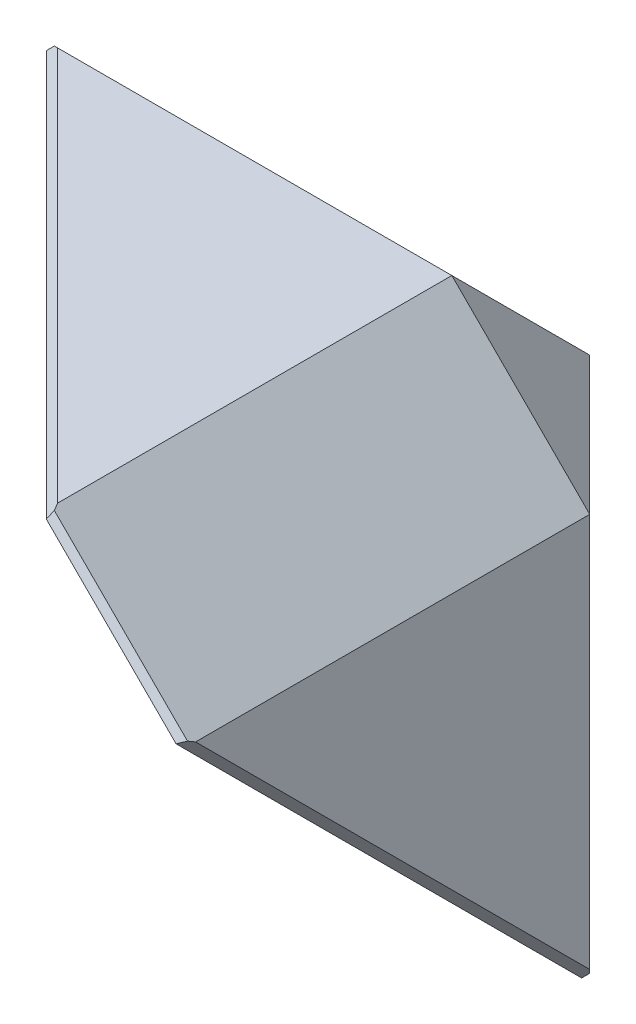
ISO-10303-21;
HEADER;
FILE_DESCRIPTION(('STEP AP214'),'2;1');
FILE_NAME('part.step','',(''),(''),'','','');
FILE_SCHEMA(('AUTOMOTIVE_DESIGN { 1 0 10303 214 1 1 1 1 }'));
ENDSEC;
DATA;
#1=APPLICATION_CONTEXT('core data for automotive mechanical design processes');
#2=APPLICATION_PROTOCOL_DEFINITION('international standard','automotive_design',2000,#1);
#3=PRODUCT_CONTEXT('',#1,'mechanical');
#4=PRODUCT('Part','Part','',(#3));
#5=PRODUCT_RELATED_PRODUCT_CATEGORY('part','',(#4));
#6=PRODUCT_DEFINITION_FORMATION('','',#4);
#7=PRODUCT_DEFINITION_CONTEXT('part definition',#1,'design');
#8=PRODUCT_DEFINITION('design','',#6,#7);
#9=PRODUCT_DEFINITION_SHAPE('','',#8);
#10=(LENGTH_UNIT() NAMED_UNIT(*) SI_UNIT(.MILLI.,.METRE.));
#11=(NAMED_UNIT(*) PLANE_ANGLE_UNIT() SI_UNIT($,.RADIAN.));
#12=(NAMED_UNIT(*) SI_UNIT($,.STERADIAN.) SOLID_ANGLE_UNIT());
#13=UNCERTAINTY_MEASURE_WITH_UNIT(LENGTH_MEASURE(1.E-05),#10,'distance_accuracy_value','');
#14=(GEOMETRIC_REPRESENTATION_CONTEXT(3) GLOBAL_UNCERTAINTY_ASSIGNED_CONTEXT((#13)) GLOBAL_UNIT_ASSIGNED_CONTEXT((#10,
#11,#12)) REPRESENTATION_CONTEXT('',''));
#15=CARTESIAN_POINT('',(0.,0.,0.));
#16=DIRECTION('',(0.,0.,1.));
#17=DIRECTION('',(1.,0.,0.));
#18=AXIS2_PLACEMENT_3D('',#15,#16,#17);
#19=CARTESIAN_POINT('',(7.5,7.5,15.));
#20=DIRECTION('',(-1.,0.,0.));
#21=DIRECTION('',(0.,-1.,0.));
#22=AXIS2_PLACEMENT_3D('',#19,#20,#21);
#23=PLANE('',#22);
#24=DIRECTION('',(0.,0.,1.));
#25=VECTOR('',#24,1.);
#26=CARTESIAN_POINT('',(7.5,4.49999999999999,15.));
#27=LINE('',#26,#25);
#28=CARTESIAN_POINT('',(7.5,4.49999999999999,3.));
#29=VERTEX_POINT('',#28);
#30=CARTESIAN_POINT('',(7.5,4.49999999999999,11.5757359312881));
#31=VERTEX_POINT('',#30);
#32=EDGE_CURVE('E155',#29,#31,#27,.T.);
#33=ORIENTED_EDGE('',*,*,#32,.T.);
#34=DIRECTION('',(0.,-0.707106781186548,-0.707106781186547));
#35=VECTOR('',#34,1.);
#36=CARTESIAN_POINT('',(7.5,-4.28786796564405,2.78786796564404));
#37=LINE('',#36,#35);
#38=CARTESIAN_POINT('',(7.5,-4.07573593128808,3.));
#39=VERTEX_POINT('',#38);
#40=EDGE_CURVE('E11',#31,#39,#37,.T.);
#41=ORIENTED_EDGE('',*,*,#40,.T.);
#42=DIRECTION('',(0.,1.,0.));
#43=VECTOR('',#42,1.);
#44=CARTESIAN_POINT('',(7.5,7.5,3.));
#45=LINE('',#44,#43);
#46=EDGE_CURVE('E153',#39,#29,#45,.T.);
#47=ORIENTED_EDGE('',*,*,#46,.T.);
#48=EDGE_LOOP('',(#33,#41,#47));
#49=FACE_BOUND('',#48,.T.);
#50=ADVANCED_FACE('F45',(#49),#23,.F.);
#51=CARTESIAN_POINT('',(-7.5,7.5,15.));
#52=DIRECTION('',(0.,-1.,0.));
#53=DIRECTION('',(0.,0.,-1.));
#54=AXIS2_PLACEMENT_3D('',#51,#52,#53);
#55=PLANE('',#54);
#56=DIRECTION('',(-1.,0.,0.));
#57=VECTOR('',#56,1.);
#58=CARTESIAN_POINT('',(-7.5,7.5,3.));
#59=LINE('',#58,#57);
#60=CARTESIAN_POINT('',(4.5,7.5,3.));
#61=VERTEX_POINT('',#60);
#62=CARTESIAN_POINT('',(-4.07573593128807,7.5,3.));
#63=VERTEX_POINT('',#62);
#64=EDGE_CURVE('E147',#61,#63,#59,.T.);
#65=ORIENTED_EDGE('',*,*,#64,.T.);
#66=DIRECTION('',(0.707106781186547,0.,0.707106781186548));
#67=VECTOR('',#66,1.);
#68=CARTESIAN_POINT('',(4.71213203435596,7.5,11.787867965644));
#69=LINE('',#68,#67);
#70=CARTESIAN_POINT('',(4.5,7.5,11.5757359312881));
#71=VERTEX_POINT('',#70);
#72=EDGE_CURVE('E198',#63,#71,#69,.T.);
#73=ORIENTED_EDGE('',*,*,#72,.T.);
#74=DIRECTION('',(0.,0.,-1.));
#75=VECTOR('',#74,1.);
#76=CARTESIAN_POINT('',(4.5,7.5,15.));
#77=LINE('',#76,#75);
#78=EDGE_CURVE('E150',#71,#61,#77,.T.);
#79=ORIENTED_EDGE('',*,*,#78,.T.);
#80=EDGE_LOOP('',(#65,#73,#79));
#81=FACE_BOUND('',#80,.T.);
#82=ADVANCED_FACE('F250',(#81),#55,.F.);
#83=CARTESIAN_POINT('',(0.,0.,0.));
#84=DIRECTION('',(0.,0.,1.));
#85=DIRECTION('',(1.,0.,0.));
#86=AXIS2_PLACEMENT_3D('',#83,#84,#85);
#87=PLANE('',#86);
#88=DIRECTION('',(0.,-1.,0.));
#89=VECTOR('',#88,1.);
#90=CARTESIAN_POINT('',(4.49999999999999,0.,0.));
#91=LINE('',#90,#89);
#92=CARTESIAN_POINT('',(4.49999999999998,4.49999999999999,0.));
#93=VERTEX_POINT('',#92);
#94=CARTESIAN_POINT('',(4.49999999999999,-4.07573593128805,0.));
#95=VERTEX_POINT('',#94);
#96=EDGE_CURVE('E160',#93,#95,#91,.T.);
#97=ORIENTED_EDGE('',*,*,#96,.T.);
#98=DIRECTION('',(-0.707106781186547,0.707106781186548,0.));
#99=VECTOR('',#98,1.);
#100=CARTESIAN_POINT('',(-4.28786796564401,4.71213203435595,0.));
#101=LINE('',#100,#99);
#102=CARTESIAN_POINT('',(-4.07573593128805,4.49999999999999,0.));
#103=VERTEX_POINT('',#102);
#104=EDGE_CURVE('E190',#95,#103,#101,.T.);
#105=ORIENTED_EDGE('',*,*,#104,.T.);
#106=DIRECTION('',(1.,0.,0.));
#107=VECTOR('',#106,1.);
#108=CARTESIAN_POINT('',(0.,4.49999999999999,0.));
#109=LINE('',#108,#107);
#110=EDGE_CURVE('E158',#103,#93,#109,.T.);
#111=ORIENTED_EDGE('',*,*,#110,.T.);
#112=EDGE_LOOP('',(#97,#105,#111));
#113=FACE_BOUND('',#112,.T.);
#114=ADVANCED_FACE('F266',(#113),#87,.F.);
#115=CARTESIAN_POINT('',(0.,0.,0.));
#116=DIRECTION('',(-0.577350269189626,-0.577350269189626,0.577350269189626));
#117=DIRECTION('',(0.707106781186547,0.,0.707106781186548));
#118=AXIS2_PLACEMENT_3D('',#115,#116,#117);
#119=PLANE('',#118);
#120=CARTESIAN_POINT('',(3.72474487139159,0.0505102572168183,3.77525512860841));
#121=DIRECTION('',(-0.577350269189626,-0.577350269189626,0.577350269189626));
#122=DIRECTION('',(0.707106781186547,0.,0.707106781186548));
#123=AXIS2_PLACEMENT_3D('',#120,#121,#122);
#124=CIRCLE('',#123,0.749999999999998);
#125=CARTESIAN_POINT('',(4.2550749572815,0.0505102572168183,4.30558521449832));
#126=VERTEX_POINT('',#125);
#127=EDGE_CURVE('E144',#126,#126,#124,.T.);
#128=ORIENTED_EDGE('',*,*,#127,.F.);
#129=EDGE_LOOP('',(#128));
#130=FACE_BOUND('',#129,.T.);
#131=DIRECTION('',(0.707106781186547,-0.707106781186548,0.));
#132=VECTOR('',#131,1.);
#133=CARTESIAN_POINT('',(4.58786796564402,-4.41213203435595,0.175735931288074));
#134=LINE('',#133,#132);
#135=CARTESIAN_POINT('',(-4.32426406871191,4.49999999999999,0.175735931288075));
#136=VERTEX_POINT('',#135);
#137=CARTESIAN_POINT('',(4.49999999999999,-4.32426406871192,0.175735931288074));
#138=VERTEX_POINT('',#137);
#139=EDGE_CURVE('E178',#136,#138,#134,.T.);
#140=ORIENTED_EDGE('',*,*,#139,.T.);
#141=DIRECTION('',(0.707106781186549,0.,0.707106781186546));
#142=VECTOR('',#141,1.);
#143=CARTESIAN_POINT('',(2.16213203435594,-4.3242640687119,-2.16213203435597));
#144=LINE('',#143,#142);
#145=CARTESIAN_POINT('',(7.32426406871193,-4.32426406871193,3.));
#146=VERTEX_POINT('',#145);
#147=EDGE_CURVE('E180',#138,#146,#144,.T.);
#148=ORIENTED_EDGE('',*,*,#147,.T.);
#149=DIRECTION('',(0.,0.707106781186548,0.707106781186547));
#150=VECTOR('',#149,1.);
#151=CARTESIAN_POINT('',(7.32426406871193,4.58786796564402,11.912132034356));
#152=LINE('',#151,#150);
#153=CARTESIAN_POINT('',(7.32426406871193,4.49999999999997,11.8242640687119));
#154=VERTEX_POINT('',#153);
#155=EDGE_CURVE('E163',#146,#154,#152,.T.);
#156=ORIENTED_EDGE('',*,*,#155,.T.);
#157=DIRECTION('',(-0.707106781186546,0.707106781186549,0.));
#158=VECTOR('',#157,1.);
#159=CARTESIAN_POINT('',(5.91213203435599,5.91213203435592,11.8242640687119));
#160=LINE('',#159,#158);
#161=CARTESIAN_POINT('',(4.49999999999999,7.32426406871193,11.8242640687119));
#162=VERTEX_POINT('',#161);
#163=EDGE_CURVE('E172',#154,#162,#160,.T.);
#164=ORIENTED_EDGE('',*,*,#163,.T.);
#165=DIRECTION('',(-0.707106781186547,0.,-0.707106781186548));
#166=VECTOR('',#165,1.);
#167=CARTESIAN_POINT('',(-4.41213203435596,7.32426406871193,2.91213203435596));
#168=LINE('',#167,#166);
#169=CARTESIAN_POINT('',(-4.32426406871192,7.32426406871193,3.));
#170=VERTEX_POINT('',#169);
#171=EDGE_CURVE('E174',#162,#170,#168,.T.);
#172=ORIENTED_EDGE('',*,*,#171,.T.);
#173=DIRECTION('',(0.,-0.707106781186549,-0.707106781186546));
#174=VECTOR('',#173,1.);
#175=CARTESIAN_POINT('',(-4.3242640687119,2.16213203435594,-2.16213203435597));
#176=LINE('',#175,#174);
#177=EDGE_CURVE('E176',#170,#136,#176,.T.);
#178=ORIENTED_EDGE('',*,*,#177,.T.);
#179=EDGE_LOOP('',(#140,#148,#156,#164,#172,#178));
#180=FACE_BOUND('',#179,.T.);
#181=CARTESIAN_POINT('',(2.5,2.5,5.));
#182=DIRECTION('',(-0.577350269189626,-0.577350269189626,0.577350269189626));
#183=DIRECTION('',(0.707106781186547,0.,0.707106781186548));
#184=AXIS2_PLACEMENT_3D('',#181,#182,#183);
#185=CIRCLE('',#184,1.02499999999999);
#186=CARTESIAN_POINT('',(3.2247844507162,2.5,5.7247844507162));
#187=VERTEX_POINT('',#186);
#188=EDGE_CURVE('E136',#187,#187,#185,.T.);
#189=ORIENTED_EDGE('',*,*,#188,.F.);
#190=EDGE_LOOP('',(#189));
#191=FACE_BOUND('',#190,.T.);
#192=ADVANCED_FACE('F225',(#130,#180,#191),#119,.T.);
#193=CARTESIAN_POINT('',(-7.5,7.5,3.));
#194=DIRECTION('',(0.,-0.707106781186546,0.707106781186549));
#195=DIRECTION('',(-1.,0.,0.));
#196=AXIS2_PLACEMENT_3D('',#193,#194,#195);
#197=PLANE('',#196);
#198=ORIENTED_EDGE('',*,*,#110,.F.);
#199=DIRECTION('',(0.862856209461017,-0.357406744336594,-0.357406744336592));
#200=VECTOR('',#199,1.);
#201=CARTESIAN_POINT('',(-8.47551565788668,6.32244843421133,1.82244843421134));
#202=LINE('',#201,#200);
#203=CARTESIAN_POINT('',(-4.19999999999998,4.55147186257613,0.0514718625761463));
#204=VERTEX_POINT('',#203);
#205=EDGE_CURVE('E196',#103,#204,#202,.F.);
#206=ORIENTED_EDGE('',*,*,#205,.T.);
#207=DIRECTION('',(0.,-0.707106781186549,-0.707106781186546));
#208=VECTOR('',#207,1.);
#209=CARTESIAN_POINT('',(-4.2,7.50000000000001,3.00000000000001));
#210=LINE('',#209,#208);
#211=CARTESIAN_POINT('',(-4.2,7.44852813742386,2.94852813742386));
#212=VERTEX_POINT('',#211);
#213=EDGE_CURVE('E194',#204,#212,#210,.F.);
#214=ORIENTED_EDGE('',*,*,#213,.T.);
#215=DIRECTION('',(-0.862856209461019,-0.357406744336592,-0.35740674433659));
#216=VECTOR('',#215,1.);
#217=CARTESIAN_POINT('',(-6.62517188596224,6.44398905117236,1.94398905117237));
#218=LINE('',#217,#216);
#219=EDGE_CURVE('E192',#212,#63,#218,.F.);
#220=ORIENTED_EDGE('',*,*,#219,.T.);
#221=ORIENTED_EDGE('',*,*,#64,.F.);
#222=DIRECTION('',(0.,-0.707106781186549,-0.707106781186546));
#223=VECTOR('',#222,1.);
#224=CARTESIAN_POINT('',(4.5,7.5,3.));
#225=LINE('',#224,#223);
#226=EDGE_CURVE('E151',#93,#61,#225,.F.);
#227=ORIENTED_EDGE('',*,*,#226,.F.);
#228=EDGE_LOOP('',(#198,#206,#214,#220,#221,#227));
#229=FACE_BOUND('',#228,.T.);
#230=ADVANCED_FACE('F268',(#229),#197,.F.);
#231=CARTESIAN_POINT('',(7.5,7.5,3.));
#232=DIRECTION('',(-0.707106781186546,0.,0.707106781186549));
#233=DIRECTION('',(0.,1.,0.));
#234=AXIS2_PLACEMENT_3D('',#231,#232,#233);
#235=PLANE('',#234);
#236=DIRECTION('',(0.707106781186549,0.,0.707106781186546));
#237=VECTOR('',#236,1.);
#238=CARTESIAN_POINT('',(7.49999999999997,-4.2,2.99999999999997));
#239=LINE('',#238,#237);
#240=CARTESIAN_POINT('',(7.44852813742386,-4.2,2.94852813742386));
#241=VERTEX_POINT('',#240);
#242=CARTESIAN_POINT('',(4.55147186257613,-4.19999999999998,0.0514718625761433));
#243=VERTEX_POINT('',#242);
#244=EDGE_CURVE('E185',#241,#243,#239,.F.);
#245=ORIENTED_EDGE('',*,*,#244,.T.);
#246=DIRECTION('',(0.357406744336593,-0.862856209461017,0.357406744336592));
#247=VECTOR('',#246,1.);
#248=CARTESIAN_POINT('',(1.69658900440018,2.69229691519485,-2.80341099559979));
#249=LINE('',#248,#247);
#250=EDGE_CURVE('E188',#243,#95,#249,.F.);
#251=ORIENTED_EDGE('',*,*,#250,.T.);
#252=ORIENTED_EDGE('',*,*,#96,.F.);
#253=DIRECTION('',(0.707106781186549,0.,0.707106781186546));
#254=VECTOR('',#253,1.);
#255=CARTESIAN_POINT('',(5.99999999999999,4.49999999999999,1.5));
#256=LINE('',#255,#254);
#257=EDGE_CURVE('E166',#29,#93,#256,.F.);
#258=ORIENTED_EDGE('',*,*,#257,.F.);
#259=ORIENTED_EDGE('',*,*,#46,.F.);
#260=DIRECTION('',(0.357406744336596,0.862856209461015,0.357406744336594));
#261=VECTOR('',#260,1.);
#262=CARTESIAN_POINT('',(11.0698484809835,4.54264068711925,6.56984848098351));
#263=LINE('',#262,#261);
#264=EDGE_CURVE('E183',#39,#241,#263,.F.);
#265=ORIENTED_EDGE('',*,*,#264,.T.);
#266=EDGE_LOOP('',(#245,#251,#252,#258,#259,#265));
#267=FACE_BOUND('',#266,.T.);
#268=ADVANCED_FACE('F244',(#267),#235,.F.);
#269=CARTESIAN_POINT('',(4.5,7.5,3.));
#270=DIRECTION('',(0.577350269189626,0.577350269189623,-0.577350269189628));
#271=DIRECTION('',(-0.707106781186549,0.,-0.707106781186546));
#272=AXIS2_PLACEMENT_3D('',#269,#270,#271);
#273=PLANE('',#272);
#274=ORIENTED_EDGE('',*,*,#257,.T.);
#275=ORIENTED_EDGE('',*,*,#226,.T.);
#276=DIRECTION('',(-0.707106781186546,0.707106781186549,0.));
#277=VECTOR('',#276,1.);
#278=CARTESIAN_POINT('',(4.5,7.5,3.));
#279=LINE('',#278,#277);
#280=EDGE_CURVE('E139',#29,#61,#279,.T.);
#281=ORIENTED_EDGE('',*,*,#280,.F.);
#282=EDGE_LOOP('',(#274,#275,#281));
#283=FACE_BOUND('',#282,.T.);
#284=ADVANCED_FACE('F247',(#283),#273,.T.);
#285=CARTESIAN_POINT('',(4.5,7.5,15.));
#286=DIRECTION('',(-0.707106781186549,-0.707106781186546,0.));
#287=DIRECTION('',(0.,0.,-1.));
#288=AXIS2_PLACEMENT_3D('',#285,#286,#287);
#289=PLANE('',#288);
#290=ORIENTED_EDGE('',*,*,#78,.F.);
#291=DIRECTION('',(-0.35740674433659,0.357406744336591,-0.862856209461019));
#292=VECTOR('',#291,1.);
#293=CARTESIAN_POINT('',(5.55601094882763,6.44398905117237,14.1251718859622));
#294=LINE('',#293,#292);
#295=CARTESIAN_POINT('',(4.55147186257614,7.44852813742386,11.7));
#296=VERTEX_POINT('',#295);
#297=EDGE_CURVE('E55',#71,#296,#294,.F.);
#298=ORIENTED_EDGE('',*,*,#297,.T.);
#299=DIRECTION('',(-0.707106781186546,0.707106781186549,0.));
#300=VECTOR('',#299,1.);
#301=CARTESIAN_POINT('',(4.49999999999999,7.50000000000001,11.7));
#302=LINE('',#301,#300);
#303=CARTESIAN_POINT('',(7.44852813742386,4.55147186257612,11.7));
#304=VERTEX_POINT('',#303);
#305=EDGE_CURVE('E67',#296,#304,#302,.F.);
#306=ORIENTED_EDGE('',*,*,#305,.T.);
#307=DIRECTION('',(-0.357406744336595,0.357406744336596,0.862856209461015));
#308=VECTOR('',#307,1.);
#309=CARTESIAN_POINT('',(5.67755156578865,6.32244843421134,15.9755156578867));
#310=LINE('',#309,#308);
#311=EDGE_CURVE('E200',#304,#31,#310,.F.);
#312=ORIENTED_EDGE('',*,*,#311,.T.);
#313=ORIENTED_EDGE('',*,*,#32,.F.);
#314=ORIENTED_EDGE('',*,*,#280,.T.);
#315=EDGE_LOOP('',(#290,#298,#306,#312,#313,#314));
#316=FACE_BOUND('',#315,.T.);
#317=ADVANCED_FACE('F237',(#316),#289,.F.);
#318=CARTESIAN_POINT('',(2.5,2.5,5.));
#319=DIRECTION('',(-0.577350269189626,-0.577350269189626,0.577350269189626));
#320=DIRECTION('',(0.707106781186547,0.,0.707106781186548));
#321=AXIS2_PLACEMENT_3D('',#318,#319,#320);
#322=CYLINDRICAL_SURFACE('',#321,1.02499999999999);
#323=CARTESIAN_POINT('',(4.72279853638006,4.72279853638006,2.77720146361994));
#324=DIRECTION('',(-0.577350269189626,-0.577350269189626,0.577350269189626));
#325=DIRECTION('',(0.707106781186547,0.,0.707106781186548));
#326=AXIS2_PLACEMENT_3D('',#323,#324,#325);
#327=CIRCLE('',#326,1.025);
#328=CARTESIAN_POINT('',(5.44758298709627,4.72279853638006,3.50198591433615));
#329=VERTEX_POINT('',#328);
#330=EDGE_CURVE('E134',#329,#329,#327,.T.);
#331=ORIENTED_EDGE('',*,*,#330,.F.);
#332=EDGE_LOOP('',(#331));
#333=FACE_BOUND('',#332,.T.);
#334=ORIENTED_EDGE('',*,*,#188,.T.);
#335=EDGE_LOOP('',(#334));
#336=FACE_BOUND('',#335,.T.);
#337=ADVANCED_FACE('F130',(#333,#336),#322,.F.);
#338=CARTESIAN_POINT('',(4.72279853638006,4.72279853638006,2.77720146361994));
#339=DIRECTION('',(-0.577350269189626,-0.577350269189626,0.577350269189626));
#340=DIRECTION('',(0.707106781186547,0.,0.707106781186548));
#341=AXIS2_PLACEMENT_3D('',#338,#339,#340);
#342=CONICAL_SURFACE('',#341,1.025,1.02974425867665);
#343=CARTESIAN_POINT('',(5.07837825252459,5.07837825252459,2.42162174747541));
#344=VERTEX_POINT('',#343);
#345=VERTEX_LOOP('',#344);
#346=FACE_BOUND('',#345,.T.);
#347=ORIENTED_EDGE('',*,*,#330,.T.);
#348=EDGE_LOOP('',(#347));
#349=FACE_BOUND('',#348,.T.);
#350=ADVANCED_FACE('F127',(#346,#349),#342,.F.);
#351=CARTESIAN_POINT('',(-3.66213203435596,7.32426406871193,3.66213203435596));
#352=DIRECTION('',(-0.499999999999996,0.707106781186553,0.499999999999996));
#353=DIRECTION('',(0.707106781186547,0.,0.707106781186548));
#354=AXIS2_PLACEMENT_3D('',#351,#352,#353);
#355=PLANE('',#354);
#356=ORIENTED_EDGE('',*,*,#72,.F.);
#357=ORIENTED_EDGE('',*,*,#219,.F.);
#358=DIRECTION('',(-0.678598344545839,-0.678598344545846,0.281084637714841));
#359=VECTOR('',#358,1.);
#360=CARTESIAN_POINT('',(-4.14565253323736,7.5028756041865,2.92601667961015));
#361=LINE('',#360,#359);
#362=EDGE_CURVE('E50',#170,#212,#361,.F.);
#363=ORIENTED_EDGE('',*,*,#362,.F.);
#364=ORIENTED_EDGE('',*,*,#171,.F.);
#365=DIRECTION('',(-0.281084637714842,-0.678598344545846,0.678598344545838));
#366=VECTOR('',#365,1.);
#367=CARTESIAN_POINT('',(4.34221543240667,6.943338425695,12.2051897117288));
#368=LINE('',#367,#366);
#369=EDGE_CURVE('E142',#296,#162,#368,.T.);
#370=ORIENTED_EDGE('',*,*,#369,.F.);
#371=ORIENTED_EDGE('',*,*,#297,.F.);
#372=EDGE_LOOP('',(#356,#357,#363,#364,#370,#371));
#373=FACE_BOUND('',#372,.T.);
#374=ADVANCED_FACE('F48',(#373),#355,.T.);
#375=CARTESIAN_POINT('',(-4.3242640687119,2.16213203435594,-2.16213203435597));
#376=DIRECTION('',(-0.707106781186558,0.49999999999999,-0.499999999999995));
#377=DIRECTION('',(0.,0.707106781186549,0.707106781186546));
#378=AXIS2_PLACEMENT_3D('',#375,#376,#377);
#379=PLANE('',#378);
#380=ORIENTED_EDGE('',*,*,#362,.T.);
#381=ORIENTED_EDGE('',*,*,#213,.F.);
#382=DIRECTION('',(-0.678598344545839,-0.281084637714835,0.678598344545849));
#383=VECTOR('',#382,1.);
#384=CARTESIAN_POINT('',(-3.69361917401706,4.76122166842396,-0.454908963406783));
#385=LINE('',#384,#383);
#386=EDGE_CURVE('E212',#136,#204,#385,.F.);
#387=ORIENTED_EDGE('',*,*,#386,.F.);
#388=ORIENTED_EDGE('',*,*,#177,.F.);
#389=EDGE_LOOP('',(#380,#381,#387,#388));
#390=FACE_BOUND('',#389,.T.);
#391=ADVANCED_FACE('F254',(#390),#379,.T.);
#392=CARTESIAN_POINT('',(5.91213203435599,5.91213203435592,11.8242640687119));
#393=DIRECTION('',(0.499999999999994,0.499999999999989,0.707106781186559));
#394=DIRECTION('',(0.707106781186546,-0.707106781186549,0.));
#395=AXIS2_PLACEMENT_3D('',#392,#393,#394);
#396=PLANE('',#395);
#397=ORIENTED_EDGE('',*,*,#369,.T.);
#398=ORIENTED_EDGE('',*,*,#163,.F.);
#399=DIRECTION('',(-0.678598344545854,-0.281084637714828,0.678598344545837));
#400=VECTOR('',#399,1.);
#401=CARTESIAN_POINT('',(9.52601667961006,5.41199579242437,9.62251145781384));
#402=LINE('',#401,#400);
#403=EDGE_CURVE('E209',#304,#154,#402,.T.);
#404=ORIENTED_EDGE('',*,*,#403,.F.);
#405=ORIENTED_EDGE('',*,*,#305,.F.);
#406=EDGE_LOOP('',(#397,#398,#404,#405));
#407=FACE_BOUND('',#406,.T.);
#408=ADVANCED_FACE('F217',(#407),#396,.T.);
#409=CARTESIAN_POINT('',(0.0878679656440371,0.0878679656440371,0.175735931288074));
#410=DIRECTION('',(-0.499999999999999,-0.499999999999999,-0.707106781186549));
#411=DIRECTION('',(-0.707106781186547,0.707106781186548,0.));
#412=AXIS2_PLACEMENT_3D('',#409,#410,#411);
#413=PLANE('',#412);
#414=ORIENTED_EDGE('',*,*,#104,.F.);
#415=ORIENTED_EDGE('',*,*,#250,.F.);
#416=DIRECTION('',(-0.28108463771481,-0.678598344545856,0.678598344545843));
#417=VECTOR('',#416,1.);
#418=CARTESIAN_POINT('',(4.99298955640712,-3.13408199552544,-1.01444614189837));
#419=LINE('',#418,#417);
#420=EDGE_CURVE('E206',#138,#243,#419,.F.);
#421=ORIENTED_EDGE('',*,*,#420,.F.);
#422=ORIENTED_EDGE('',*,*,#139,.F.);
#423=ORIENTED_EDGE('',*,*,#386,.T.);
#424=ORIENTED_EDGE('',*,*,#205,.F.);
#425=EDGE_LOOP('',(#414,#415,#421,#422,#423,#424));
#426=FACE_BOUND('',#425,.T.);
#427=ADVANCED_FACE('F260',(#426),#413,.T.);
#428=CARTESIAN_POINT('',(7.32426406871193,-3.66213203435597,3.66213203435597));
#429=DIRECTION('',(0.707106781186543,-0.500000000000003,0.500000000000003));
#430=DIRECTION('',(0.,-0.707106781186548,-0.707106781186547));
#431=AXIS2_PLACEMENT_3D('',#428,#429,#430);
#432=PLANE('',#431);
#433=ORIENTED_EDGE('',*,*,#403,.T.);
#434=ORIENTED_EDGE('',*,*,#155,.F.);
#435=DIRECTION('',(0.678598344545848,0.678598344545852,-0.281084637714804));
#436=VECTOR('',#435,1.);
#437=CARTESIAN_POINT('',(7.50287560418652,-4.14565253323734,2.92601667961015));
#438=LINE('',#437,#436);
#439=EDGE_CURVE('E204',#241,#146,#438,.F.);
#440=ORIENTED_EDGE('',*,*,#439,.F.);
#441=ORIENTED_EDGE('',*,*,#264,.F.);
#442=ORIENTED_EDGE('',*,*,#40,.F.);
#443=ORIENTED_EDGE('',*,*,#311,.F.);
#444=EDGE_LOOP('',(#433,#434,#440,#441,#442,#443));
#445=FACE_BOUND('',#444,.T.);
#446=ADVANCED_FACE('F232',(#445),#432,.T.);
#447=CARTESIAN_POINT('',(2.16213203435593,-4.3242640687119,-2.16213203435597));
#448=DIRECTION('',(0.500000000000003,-0.707106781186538,-0.500000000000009));
#449=DIRECTION('',(-0.707106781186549,0.,-0.707106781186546));
#450=AXIS2_PLACEMENT_3D('',#447,#448,#449);
#451=PLANE('',#450);
#452=ORIENTED_EDGE('',*,*,#420,.T.);
#453=ORIENTED_EDGE('',*,*,#244,.F.);
#454=ORIENTED_EDGE('',*,*,#439,.T.);
#455=ORIENTED_EDGE('',*,*,#147,.F.);
#456=EDGE_LOOP('',(#452,#453,#454,#455));
#457=FACE_BOUND('',#456,.T.);
#458=ADVANCED_FACE('F264',(#457),#451,.T.);
#459=CARTESIAN_POINT('',(4.87944540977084,1.20521079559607,2.62055459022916));
#460=DIRECTION('',(-0.577350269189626,-0.577350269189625,0.577350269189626));
#461=DIRECTION('',(0.707106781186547,0.,0.707106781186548));
#462=AXIS2_PLACEMENT_3D('',#459,#460,#461);
#463=CYLINDRICAL_SURFACE('',#462,0.749999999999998);
#464=CARTESIAN_POINT('',(4.87944540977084,1.20521079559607,2.62055459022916));
#465=DIRECTION('',(-0.577350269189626,-0.577350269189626,0.577350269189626));
#466=DIRECTION('',(0.707106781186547,0.,0.707106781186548));
#467=AXIS2_PLACEMENT_3D('',#464,#465,#466);
#468=CIRCLE('',#467,0.749999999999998);
#469=CARTESIAN_POINT('',(5.40977549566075,1.20521079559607,3.15088467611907));
#470=VERTEX_POINT('',#469);
#471=EDGE_CURVE('E207',#470,#470,#468,.T.);
#472=ORIENTED_EDGE('',*,*,#471,.F.);
#473=EDGE_LOOP('',(#472));
#474=FACE_BOUND('',#473,.T.);
#475=ORIENTED_EDGE('',*,*,#127,.T.);
#476=EDGE_LOOP('',(#475));
#477=FACE_BOUND('',#476,.T.);
#478=ADVANCED_FACE('F356',(#474,#477),#463,.F.);
#479=CARTESIAN_POINT('',(4.87944540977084,1.20521079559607,2.62055459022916));
#480=DIRECTION('',(-0.577350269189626,-0.577350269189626,0.577350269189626));
#481=DIRECTION('',(0.707106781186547,0.,0.707106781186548));
#482=AXIS2_PLACEMENT_3D('',#479,#480,#481);
#483=PLANE('',#482);
#484=ORIENTED_EDGE('',*,*,#471,.T.);
#485=EDGE_LOOP('',(#484));
#486=FACE_BOUND('',#485,.T.);
#487=ADVANCED_FACE('F362',(#486),#483,.T.);
#488=CLOSED_SHELL('',(#50,#82,#114,#192,#230,#268,#284,#317,#337,#350,#374,#391,#408,#427,#446,
#458,#478,#487));
#489=MANIFOLD_SOLID_BREP('B2',#488);
#490=ADVANCED_BREP_SHAPE_REPRESENTATION('',(#18,#489),#14);
#491=SHAPE_DEFINITION_REPRESENTATION(#9,#490);
ENDSEC;
END-ISO-10303-21;
